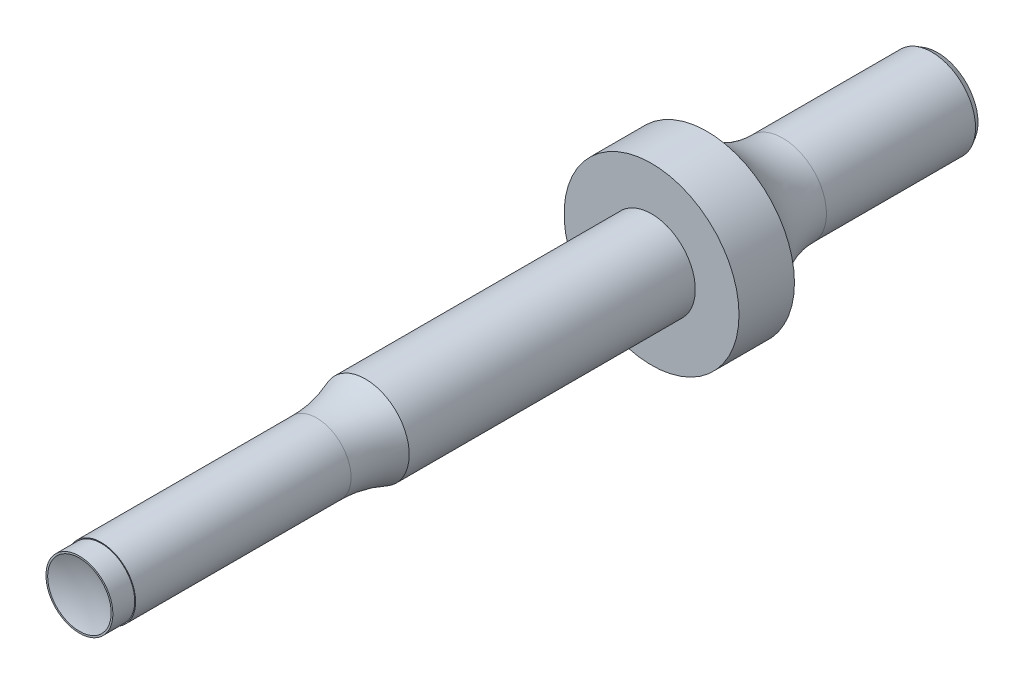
from build123d import *

# Parameters (mm, degrees)
SKETCH1_R           = 5.095
BOSS_EXTRUDE1_DEPTH = 100
SKETCH2_OUTSIDE_W   = 32.396
SKETCH2_OUTSIDE_H   = 32.396
SKETCH2_OUTSIDE_R   = 4
CUT_EXTRUDE1_DEPTH  = 33.333333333
SKETCH3_OUTSIDE_W   = 32.396
SKETCH3_OUTSIDE_H   = 32.396
SKETCH3_OUTSIDE_R   = 3.9
CUT_EXTRUDE2_DEPTH  = 2.5475
CHAMFER1_SIZE       = 0.679333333
CHAMFER1_SIZE2      = 0.392213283


with BuildPart() as part:
    # Sketch1 → Boss-Extrude1 (new body)
    with BuildSketch(Plane.XY):
        Circle(SKETCH1_R)
    extrude(amount=-BOSS_EXTRUDE1_DEPTH)

    # Sketch2 outside → Cut-Extrude1 (cut)
    with BuildSketch(Plane.XY):
        Rectangle(SKETCH2_OUTSIDE_W, SKETCH2_OUTSIDE_H)
        Circle(SKETCH2_OUTSIDE_R, mode=Mode.SUBTRACT)
    extrude(amount=-CUT_EXTRUDE1_DEPTH, mode=Mode.SUBTRACT)

    # Sketch3 outside → Cut-Extrude2 (cut)
    with BuildSketch(Plane.XY):
        Rectangle(SKETCH3_OUTSIDE_W, SKETCH3_OUTSIDE_H)
        Circle(SKETCH3_OUTSIDE_R, mode=Mode.SUBTRACT)
    extrude(amount=-CUT_EXTRUDE2_DEPTH, mode=Mode.SUBTRACT)

    # Sketch4 → Cut-Revolve1 (revolve, cut)
    with BuildSketch(Plane(origin=(0, 0, 0), x_dir=(0, 0, -1), z_dir=(1, 0, 0))):
        with BuildLine():
            Line((0, 0), (0, 3.7))
            ThreePointArc((0, 3.7), (0.520093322, 1.882397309), (0.695469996, 0))
            Line((0.695469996, 0), (0, 0))
        make_face()
    revolve(axis=Axis((0, 0, 0), (0, 0, -1)), mode=Mode.SUBTRACT)

    # Chamfer1
    chamfer1_edges = [part.edges().sort_by_distance(p)[0] for p in [
        (-5.095, 0, -100),
    ]]
    chamfer1_side = [part.faces().sort_by_distance(p)[0] for p in [
        (-5.095, 0, -66.666666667),
    ]]
    chamfer(chamfer1_edges, length=CHAMFER1_SIZE, length2=CHAMFER1_SIZE2, reference=chamfer1_side[0])

    # Sketch5 → Revolve1 (revolve)
    with BuildSketch(Plane(origin=(0, 0, 0), x_dir=(0, 0, -1), z_dir=(1, 0, 0)), mode=Mode.PRIVATE) as revolve1_sk:
        with BuildLine():
            Line((33.333333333, 0), (27.652213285, 0))
            Line((27.652213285, 0), (27.652213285, 4))
            ThreePointArc((27.652213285, 4), (30.545055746, 4.276246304), (33.333333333, 5.095))
            Line((33.333333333, 5.095), (33.333333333, 0))
        make_face()
    revolve(revolve1_sk.sketch.rotate(Axis((0, 0, -33.333333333), (0, 0, 1)), 270), axis=Axis((0, 0, -33.333333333), (0, 0, 1)))

    # Sketch6 → Revolve2 (revolve)
    with BuildSketch(Plane(origin=(0, 0, 0), x_dir=(0, 0, -1), z_dir=(1, 0, 0)), mode=Mode.PRIVATE) as revolve2_sk:
        with BuildLine():
            Line((66.666666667, 0), (81.951666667, 0))
            Line((81.951666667, 0), (81.951666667, 5.095))
            ThreePointArc((81.951666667, 5.095), (76.856666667, 6.460201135), (73.126867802, 10.19))
            Line((73.126867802, 10.19), (66.666666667, 10.19))
            Line((66.666666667, 10.19), (66.666666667, 0))
        make_face()
    revolve(revolve2_sk.sketch.rotate(Axis((0, 0, -66.666666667), (0, 0, -1)), 90), axis=Axis((0, 0, -66.666666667), (0, 0, -1)))


solid = part.part
